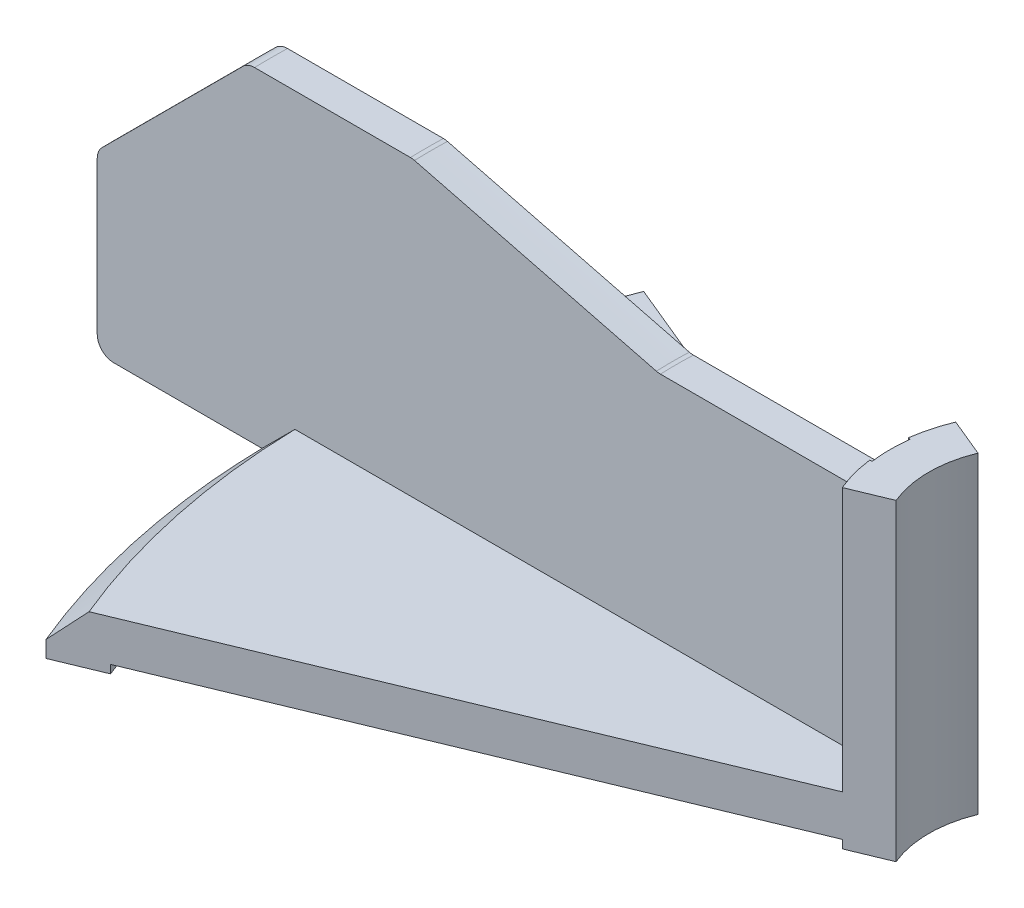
from build123d import *

# Parameters (mm, degrees)
BOSS_EXTRUDE1_DEPTH      = 20
CUT_REVOLVE2_ANGLE       = 15
CUT_REVOLVE3_ANGLE       = 15
FILLET1_R                = 1
CIRPATTERN1_COUNT        = 8
FILLET1_OF_CIRPATTERN1_R = 1


with BuildPart() as part:
    # Sketch1 → Revolve1 (revolve)
    with BuildSketch(Plane.XY, mode=Mode.PRIVATE) as revolve1_sk:
        Polygon((6.5, 19), (6.5, 0), (9, 0), (9, 0.5), (43, 0.5), (43, 0), (46, 0), (46, 1), (44, 3), (9, 3), (9, 19), align=None)
    revolve(revolve1_sk.sketch.rotate(Axis((0, 23, 0), (0, -1, 0)), 90), axis=Axis((0, 23, 0), (0, -1, 0)))

    # Sketch3 → Boss-Extrude1 (add, symmetric)
    with BuildSketch(Plane(origin=(0, 3, 0), x_dir=(1, 0, 0), z_dir=(0, 1, 0))):
        with BuildLine():
            Line((8.865228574, 1), (55.991070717, 1))
            ThreePointArc((55.991070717, 1), (56, 0), (55.991070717, -1))
            Line((55.991070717, -1), (8.865228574, -1))
            ThreePointArc((8.865228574, -1), (8.921450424, 0), (8.865228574, 1))
        make_face()
    boss_extrude1 = extrude(amount=BOSS_EXTRUDE1_DEPTH, both=True)

    # Sketch6 → Cut-Revolve2 (revolve, symmetric, cut)
    with BuildSketch(Plane.XY) as cut_revolve2_sk:
        Polygon((8.865228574, 17), (8.865228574, 23), (61.360894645, 23), (61.360894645, 6.304333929), (46.865228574, 20.8), (36.865228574, 20.8), (21.94427191, 17), (8.94427191, 17), align=None)
    cut_revolve2 = revolve(axis=Axis((0, 0, 0), (0, 1, 0)), revolution_arc=CUT_REVOLVE2_ANGLE / 2, mode=Mode.SUBTRACT)
    cut_revolve2 = cut_revolve2 + revolve(cut_revolve2_sk.sketch, axis=Axis((0, 0, 0), (0, -1, 0)), revolution_arc=CUT_REVOLVE2_ANGLE / 2, mode=Mode.SUBTRACT)

    # Sketch8 → Cut-Revolve3 (revolve, symmetric, cut)
    with BuildSketch(Plane.XY) as cut_revolve3_sk:
        Polygon((45.98912915, 1), (61.915089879, 1), (61.915089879, -17), (8.865228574, -17), (8.865228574, 0), (8.94427191, 0), (8.94427191, 0.5), (42.98837052, 0.5), (42.98837052, 0), (45.98912915, 0), align=None)
    cut_revolve3 = revolve(axis=Axis((-0.005435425, 0, 0), (0, 1, 0)), revolution_arc=CUT_REVOLVE3_ANGLE / 2, mode=Mode.SUBTRACT)
    cut_revolve3 = cut_revolve3 + revolve(cut_revolve3_sk.sketch, axis=Axis((-0.005435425, 0, 0), (0, -1, 0)), revolution_arc=CUT_REVOLVE3_ANGLE / 2, mode=Mode.SUBTRACT)

    # Fillet1
    fillet1_edges = [part.edges().sort_by_distance(p)[0] for p in [
        (36.865228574, 20.8, 0),
        (21.94427191, 17, 0),
        (46.865228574, 20.8, 0),
        (55.999999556, 11.665228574, 1e-09),
        (56, 1, 0),
    ]]
    fillet(fillet1_edges, radius=FILLET1_R)

    # CirPattern1: Boss-Extrude1, Cut-Revolve2, Cut-Revolve3 ×8 about axis
    cirpattern1_axis = Axis((0, 0, 0), (0, 1, 0))
    add([boss_extrude1.rotate(cirpattern1_axis, i * 360 / CIRPATTERN1_COUNT) for i in range(1, CIRPATTERN1_COUNT)])
    add([cut_revolve2.rotate(cirpattern1_axis, i * 360 / CIRPATTERN1_COUNT) for i in range(1, CIRPATTERN1_COUNT)], mode=Mode.SUBTRACT)
    add([cut_revolve3.rotate(cirpattern1_axis, i * 360 / CIRPATTERN1_COUNT) for i in range(1, CIRPATTERN1_COUNT)], mode=Mode.SUBTRACT)

    # Fillet1 of CirPattern1
    fillet1_of_cirpattern1_edges = [part.edges().sort_by_distance(p)[0] for p in [
        (26.067653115, 20.8, -26.067653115),
        (15.516943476, 17, -15.516943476),
        (33.138720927, 20.8, -33.138720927),
        (39.597979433, 11.665228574, -39.597979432),
        (39.597979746, 1, -39.597979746),
        (0, 20.8, -36.865228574),
        (0, 17, -21.94427191),
        (0, 20.8, -46.865228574),
        (1e-09, 11.665228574, -55.999999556),
        (0, 1, -56),
        (-26.067653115, 20.8, -26.067653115),
        (-15.516943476, 17, -15.516943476),
        (-33.138720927, 20.8, -33.138720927),
        (-39.597979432, 11.665228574, -39.597979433),
        (-39.597979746, 1, -39.597979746),
        (-36.865228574, 20.8, 0),
        (-21.94427191, 17, 0),
        (-46.865228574, 20.8, 0),
        (-55.999999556, 11.665228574, -1e-09),
        (-56, 1, 0),
        (-26.067653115, 20.8, 26.067653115),
        (-15.516943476, 17, 15.516943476),
        (-33.138720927, 20.8, 33.138720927),
        (-39.597979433, 11.665228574, 39.597979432),
        (-39.597979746, 1, 39.597979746),
        (0, 20.8, 36.865228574),
        (0, 17, 21.94427191),
        (0, 20.8, 46.865228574),
        (-1e-09, 11.665228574, 55.999999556),
        (0, 1, 56),
        (26.067653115, 20.8, 26.067653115),
        (15.516943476, 17, 15.516943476),
        (33.138720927, 20.8, 33.138720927),
        (39.597979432, 11.665228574, 39.597979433),
        (39.597979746, 1, 39.597979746),
    ]]
    fillet(fillet1_of_cirpattern1_edges, radius=FILLET1_OF_CIRPATTERN1_R)

    # SurfaceCut5
    split(bisect_by=Plane(origin=(0, 0, 0), x_dir=(0, 1, 0), z_dir=(-0.38268343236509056, 0, 0.9238795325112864)), keep=Keep.TOP)

    # SurfaceCut6
    split(bisect_by=Plane(origin=(0, 0, 0), x_dir=(0, 1, 0), z_dir=(0.38268343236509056, 0, 0.9238795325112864)), keep=Keep.BOTTOM)


solid = part.part
